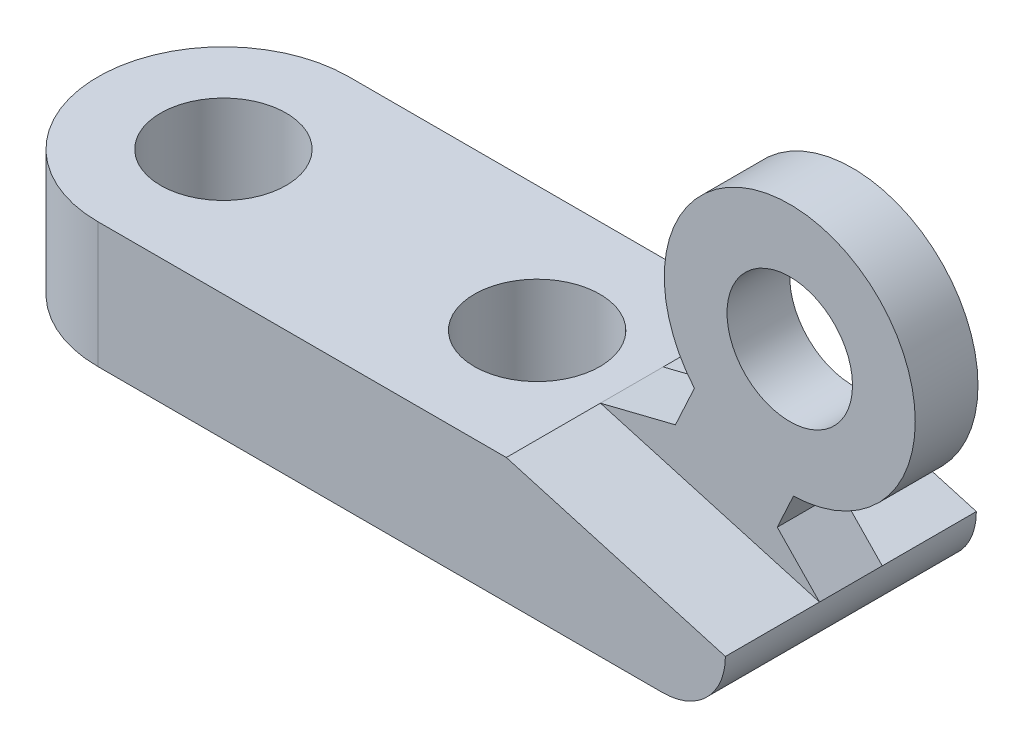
from build123d import *

# Parameters (mm, degrees)
SKETCH1_R           = 0.5
SKETCH1_R_2         = 1
BOSS_EXTRUDE1_DEPTH = 1
FILLET1_R           = 0.5
CUT_EXTRUDE1_DEPTH  = 2
BOSS_EXTRUDE2_START = -0.75
SKETCH3_R           = 0.5
BOSS_EXTRUDE2_DEPTH = 0.5


with BuildPart() as part:
    # Sketch1 → Boss-Extrude1 (new body)
    # profile 1 of 2: a face of its own
    with BuildSketch(Plane(origin=(0, 0, 0), x_dir=(1, 0, 0), z_dir=(0, 1, 0))):
        with BuildLine():
            Line((5, 1), (0, 1))
            ThreePointArc((0, 1), (0.707106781, 0.707106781), (1, 0))
            ThreePointArc((1, 0), (0.707106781, -0.707106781), (0, -1))
            Line((0, -1), (5, -1))
            Line((5, -1), (5, 1))
        make_face()
        with Locations(Location((2.5, 0, 0), (0, 0, 270))):
            Circle(SKETCH1_R, mode=Mode.SUBTRACT)
    # profile 2 of 2: a face of its own
    with BuildSketch(Plane(origin=(0, 0, 0), x_dir=(1, 0, 0), z_dir=(0, 1, 0))):
        Circle(SKETCH1_R_2)
        with Locations(Location((0, 0, 0), (0, 0, 270))):
            Circle(SKETCH1_R, mode=Mode.SUBTRACT)
    extrude(amount=BOSS_EXTRUDE1_DEPTH)

    # Fillet1
    fillet1_edges = [part.edges().sort_by_distance(p)[0] for p in [
        (5, 0, 0),
    ]]
    fillet(fillet1_edges, radius=FILLET1_R)

    # Sketch2 → Cut-Extrude1 (cut)
    with BuildSketch(Plane.XY.offset(1)):
        Polygon((5, 0.5), (3.254350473, 1), (5, 1), align=None)
    extrude(amount=-CUT_EXTRUDE1_DEPTH, mode=Mode.SUBTRACT)


with BuildPart() as body_2:
    # Sketch3 → Boss-Extrude2 (new body)
    with BuildSketch(Plane.XY.offset(1).offset(BOSS_EXTRUDE2_START)):
        with BuildLine():
            Line((4.003213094, 1.477117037), (3.85181056, 1.149150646))
            Line((3.85181056, 1.149150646), (3.254350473, 1))
            Line((3.254350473, 1), (5, 0.5))
            Line((5, 0.5), (4.663402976, 0.848350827))
            Line((4.663402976, 0.848350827), (4.792375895, 1.127730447))
            ThreePointArc((4.792375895, 1.127730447), (5.167821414, 3.04169084), (4.003213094, 1.477117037))
        make_face()
        with Locations((4.762991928, 2.127298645)):
            Circle(SKETCH3_R, mode=Mode.SUBTRACT)
    extrude(amount=-BOSS_EXTRUDE2_DEPTH)


solid = Compound([part.part, body_2.part])
